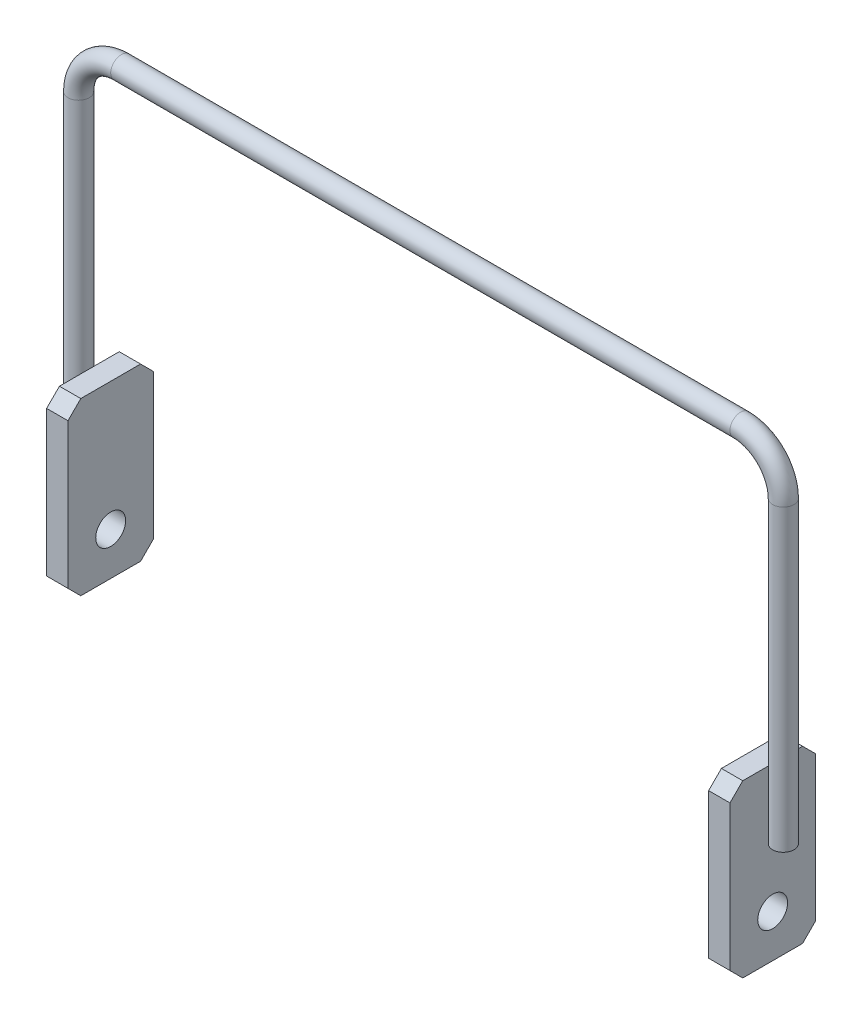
from build123d import *

# Parameters (mm, degrees)
ESQUISSE1_W             = 5
ESQUISSE1_H             = 40
EXTRUSION1_DEPTH        = 10
EXTRUSION1_2_DEPTH      = 10
ESQUISSE2_R             = 3.5
ENL_V_MAT_EXTRU_1_DEPTH = 166.227116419
ESQUISSE3_R             = 2.5
CHANFREIN1_SIZE         = 3
CHANFREIN2_SIZE         = 3


with BuildPart() as part:
    # Esquisse1 → Extrusion1 (new, symmetric)
    with BuildSketch(Plane.XY):
        with Locations((77.5, 20)):
            Rectangle(ESQUISSE1_W, ESQUISSE1_H)
    extrude(amount=EXTRUSION1_DEPTH, both=True)


with BuildPart() as body_2:
    # Esquisse1 → Extrusion1 2 (new, symmetric)
    with BuildSketch(Plane.XY):
        with Locations((-77.5, 20)):
            Rectangle(ESQUISSE1_W, ESQUISSE1_H)
    extrude(amount=EXTRUSION1_2_DEPTH, both=True)


with BuildPart() as enl_v_mat_extru_1_tool:
    # Esquisse2 → Enl_v. mat.-Extru.1 (new, through all)
    with BuildSketch(Plane.ZY.offset(80)):
        with Locations((0, 10)):
            Circle(ESQUISSE2_R)
    extrude(amount=-ENL_V_MAT_EXTRU_1_DEPTH)


with BuildPart() as part_1:
    add(part.part)

    # Enl_v. mat.-Extru.1: cut by enl_v_mat_extru_1_tool
    add(enl_v_mat_extru_1_tool.part, mode=Mode.SUBTRACT)

    # Chanfrein2
    chanfrein2_edges = [part_1.edges().sort_by_distance(p)[0] for p in [
        (77.5, 0, 10),
        (77.5, 40, 10),
        (77.5, 0, -10),
        (77.5, 40, -10),
    ]]
    chamfer(chanfrein2_edges, length=CHANFREIN2_SIZE)


with BuildPart() as body_2_1:
    add(body_2.part)

    # Enl_v. mat.-Extru.1: cut by enl_v_mat_extru_1_tool
    add(enl_v_mat_extru_1_tool.part, mode=Mode.SUBTRACT)

    # Chanfrein1
    chanfrein1_edges = [body_2_1.edges().sort_by_distance(p)[0] for p in [
        (-77.5, 40, 10),
        (-77.5, 40, -10),
        (-77.5, 0, -10),
        (-77.5, 0, 10),
    ]]
    chamfer(chanfrein1_edges, length=CHANFREIN1_SIZE)


with BuildPart() as body_3:
    # Balayage1: sweep along a path in Esquisse4
    with BuildLine(Plane.XY) as balayage1_path:
        Line((82.5, 25), (82.5, 95))
        ThreePointArc((82.5, 95), (79.571067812, 102.071067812), (72.5, 105))
        Line((72.5, 105), (-72.5, 105))
        ThreePointArc((-72.5, 105), (-79.571067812, 102.071067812), (-82.5, 95))
        Line((-82.5, 95), (-82.5, 25))
    # Esquisse3 → Balayage1 (sweep)
    with BuildSketch(Plane(origin=(0, 25, 0), x_dir=(-1, 0, 0), z_dir=(0, 1, 0))):
        with Locations((-82.5, 0)):
            Circle(ESQUISSE3_R)
    sweep(path=balayage1_path.line)


solid = Compound([part_1.part, body_2_1.part, body_3.part])
